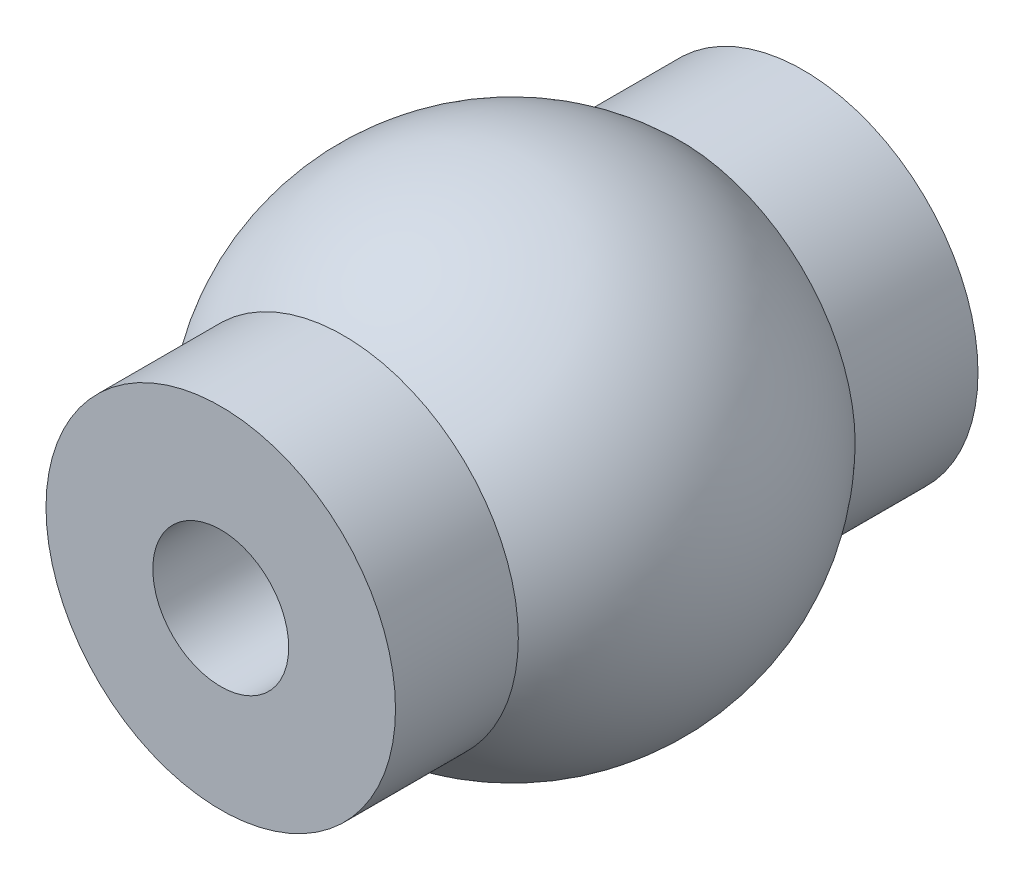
from build123d import *

# Parameters (mm, degrees)
ENL_V_MAT_EXTRU_1_DEPTH      = 30
ENL_V_MAT_EXTRU_1_DEPTH_BACK = 30
ESQUISSE2_R                  = 3.5
EXTRUSION1_DEPTH             = 15
EXTRUSION1_DEPTH_BACK        = 15
ESQUISSE3_R                  = 9
ESQUISSE3_R_2                = 3.5


with BuildPart() as part:
    # Esquisse1 → R_volution1 (revolve)
    with BuildSketch(Plane.XY):
        with BuildLine():
            Line((0, 12.5), (0, -12.5))
            ThreePointArc((0, -12.5), (12.5, 0), (0, 12.5))
        make_face()
    revolve(axis=Axis((0, 25.160014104, 0), (0, -1, 0)))

    # Esquisse2 → Enl_v. mat.-Extru.1 (cut, two sides: drawn at the far end of the back side and taken through both)
    with BuildSketch(Plane.XY.offset(-ENL_V_MAT_EXTRU_1_DEPTH_BACK)):
        Circle(ESQUISSE2_R)
    extrude(amount=ENL_V_MAT_EXTRU_1_DEPTH + ENL_V_MAT_EXTRU_1_DEPTH_BACK, mode=Mode.SUBTRACT)

    # Esquisse3 → Extrusion1 (add, two sides: drawn at the far end of the back side and taken through both)
    with BuildSketch(Plane.XY.offset(-EXTRUSION1_DEPTH_BACK)):
        with Locations(Location((0, 0, 0), (0, 0, 180))):
            Circle(ESQUISSE3_R)
        Circle(ESQUISSE3_R_2, mode=Mode.SUBTRACT)
    extrude(amount=EXTRUSION1_DEPTH + EXTRUSION1_DEPTH_BACK)


solid = part.part
